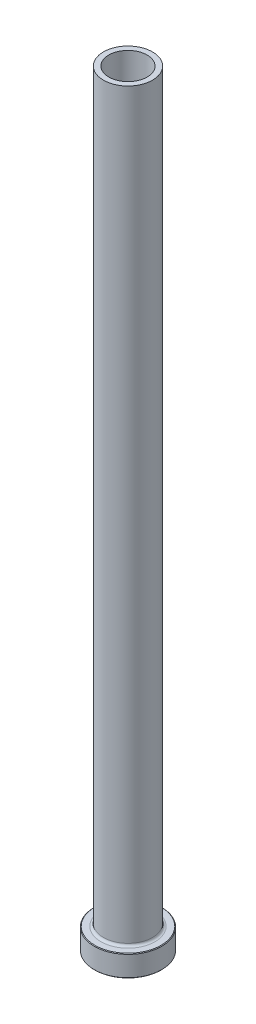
from build123d import *

# Parameters (mm, degrees)
FILLET1_R     = 0.8
CHAMFER1_SIZE = 0.2
CHAMFER3_SIZE = 0.5


with BuildPart() as part:
    # Sketch1 → Revolve1 (revolve)
    with BuildSketch(Plane.XY, mode=Mode.PRIVATE) as revolve1_sk:
        Polygon((-6.25, 250), (-8, 250), (-8, 7), (-11, 7), (-11, 0), (-6.5, 0), (-6.5, 183), (-6.25, 195), align=None)
    revolve(revolve1_sk.sketch.rotate(Axis((0, 92.187680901, 0), (0, -1, 0)), 270), axis=Axis((0, 92.187680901, 0), (0, -1, 0)))

    # Fillet1
    fillet1_edges = [part.edges().sort_by_distance(p)[0] for p in [
        (0, 7, -8),
    ]]
    fillet(fillet1_edges, radius=FILLET1_R)

    # Chamfer1
    chamfer1_edges = [part.edges().sort_by_distance(p)[0] for p in [
        (0, 0, -11),
        (0, 7, -11),
    ]]
    chamfer(chamfer1_edges, length=CHAMFER1_SIZE)

    # Chamfer3
    chamfer3_edges = [part.edges().sort_by_distance(p)[0] for p in [
        (0, 0, -6.5),
    ]]
    chamfer(chamfer3_edges, length=CHAMFER3_SIZE)


solid = part.part
